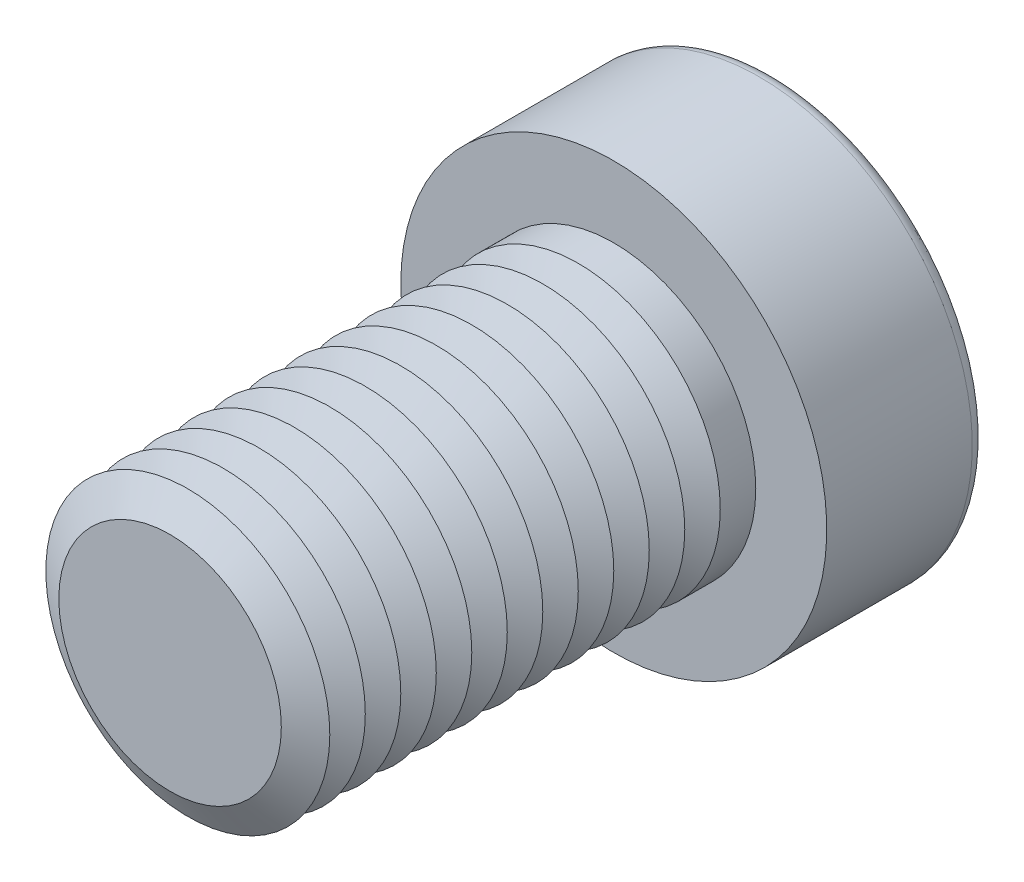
from build123d import *

# Parameters (mm, degrees)
SKETCH1_R           = 8
BOSS_EXTRUDE1_DEPTH = 25
SKETCH2_R           = 12
BOSS_EXTRUDE2_DEPTH = 9
CUT_EXTRUDE1_DEPTH  = 9
FILLET1_R           = 0.8
LPATTERN1_COUNT     = 12
LPATTERN1_PITCH     = 2


with BuildPart() as part:
    # Sketch1 → Boss-Extrude1 (new body)
    with BuildSketch(Plane.XY):
        Circle(SKETCH1_R)
    extrude(amount=BOSS_EXTRUDE1_DEPTH)

    # Sketch2 → Boss-Extrude2 (add)
    with BuildSketch(Plane(origin=(0, 0, 0), x_dir=(-1, 0, 0), z_dir=(0, 0, -1))):
        Circle(SKETCH2_R)
    extrude(amount=BOSS_EXTRUDE2_DEPTH)

    # Sketch3 → Cut-Extrude1 (cut)
    with BuildSketch(Plane(origin=(0, 0, -9), x_dir=(-1, 0, 0), z_dir=(0, 0, -1))):
        Polygon((-3.464101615, 6), (-6.92820323, 0), (-3.464101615, -6), (3.464101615, -6), (6.92820323, 0), (3.464101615, 6), align=None)
    extrude(amount=-CUT_EXTRUDE1_DEPTH, mode=Mode.SUBTRACT)

    # Fillet1
    fillet1_edges = [part.edges().sort_by_distance(p)[0] for p in [
        (12, 0, -9),
    ]]
    fillet(fillet1_edges, radius=FILLET1_R)

    # Cut-Extrude2 cone 1 section (on through the dimple's axis) → Cut-Extrude2 (revolve, cut)
    with BuildSketch(Plane.YZ):
        Polygon((0, 0), (6, 0), (0, 3.464101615), align=None)
    revolve(axis=Axis((0, 0, 0), (0, 0, 1)), mode=Mode.SUBTRACT)

    # Cut-Extrude3 cone 1 section (on through the dimple's axis) → Cut-Extrude3 (revolve, cut)
    with BuildSketch(Plane(origin=(0, 0, -9), x_dir=(0, 1, 0), z_dir=(1, 0, 0))):
        Polygon((0, 0), (6.92820323, 0), (0, 1.856406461), align=None)
    revolve(axis=Axis((0, 0, -9), (0, 0, 1)), mode=Mode.SUBTRACT)

    # Sketch7 → Cut-Revolve1 (revolve, cut)
    with BuildSketch(Plane(origin=(0, 0, 0), x_dir=(0, 0, -1), z_dir=(1, 0, 0)), mode=Mode.PRIVATE) as cut_revolve1_sk:
        Polygon((-25, 6.267949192), (-24, 8), (-26, 8), align=None)
    cut_revolve1 = revolve(cut_revolve1_sk.sketch.rotate(Axis((0, 0, 25), (0, 0, -1)), 90), axis=Axis((0, 0, 25), (0, 0, -1)), mode=Mode.SUBTRACT)

    # LPattern1: Cut-Revolve1 ×12
    with Locations(*[(0, 0, -i * LPATTERN1_PITCH) for i in range(1, LPATTERN1_COUNT)]):
        add(cut_revolve1, mode=Mode.SUBTRACT)


solid = part.part
